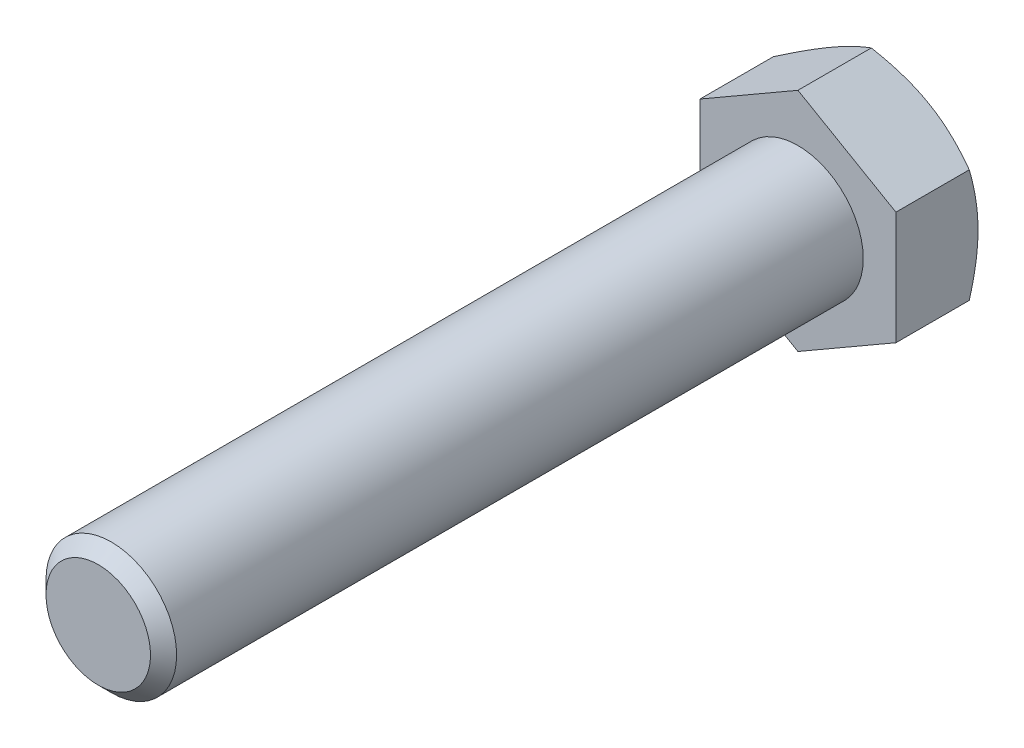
ISO-10303-21;
HEADER;
FILE_DESCRIPTION(('STEP AP214'),'2;1');
FILE_NAME('part.step','',(''),(''),'','','');
FILE_SCHEMA(('AUTOMOTIVE_DESIGN { 1 0 10303 214 1 1 1 1 }'));
ENDSEC;
DATA;
#1=APPLICATION_CONTEXT('core data for automotive mechanical design processes');
#2=APPLICATION_PROTOCOL_DEFINITION('international standard','automotive_design',2000,#1);
#3=PRODUCT_CONTEXT('',#1,'mechanical');
#4=PRODUCT('Part','Part','',(#3));
#5=PRODUCT_RELATED_PRODUCT_CATEGORY('part','',(#4));
#6=PRODUCT_DEFINITION_FORMATION('','',#4);
#7=PRODUCT_DEFINITION_CONTEXT('part definition',#1,'design');
#8=PRODUCT_DEFINITION('design','',#6,#7);
#9=PRODUCT_DEFINITION_SHAPE('','',#8);
#10=(LENGTH_UNIT() NAMED_UNIT(*) SI_UNIT(.MILLI.,.METRE.));
#11=(NAMED_UNIT(*) PLANE_ANGLE_UNIT() SI_UNIT($,.RADIAN.));
#12=(NAMED_UNIT(*) SI_UNIT($,.STERADIAN.) SOLID_ANGLE_UNIT());
#13=UNCERTAINTY_MEASURE_WITH_UNIT(LENGTH_MEASURE(1.E-05),#10,'distance_accuracy_value','');
#14=(GEOMETRIC_REPRESENTATION_CONTEXT(3) GLOBAL_UNCERTAINTY_ASSIGNED_CONTEXT((#13)) GLOBAL_UNIT_ASSIGNED_CONTEXT((#10,
#11,#12)) REPRESENTATION_CONTEXT('',''));
#15=CARTESIAN_POINT('',(0.,0.,0.));
#16=DIRECTION('',(0.,0.,1.));
#17=DIRECTION('',(1.,0.,0.));
#18=AXIS2_PLACEMENT_3D('',#15,#16,#17);
#19=CARTESIAN_POINT('',(0.,0.,75.));
#20=DIRECTION('',(0.,0.,1.));
#21=DIRECTION('',(1.,0.,0.));
#22=AXIS2_PLACEMENT_3D('',#19,#20,#21);
#23=PLANE('',#22);
#24=CARTESIAN_POINT('',(0.,0.,75.));
#25=DIRECTION('',(0.,0.,1.));
#26=DIRECTION('',(1.,0.,0.));
#27=AXIS2_PLACEMENT_3D('',#24,#25,#26);
#28=CIRCLE('',#27,5.60000000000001);
#29=CARTESIAN_POINT('',(-5.59999999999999,0.,75.));
#30=VERTEX_POINT('',#29);
#31=EDGE_CURVE('E271',#30,#30,#28,.T.);
#32=ORIENTED_EDGE('',*,*,#31,.T.);
#33=EDGE_LOOP('',(#32));
#34=FACE_BOUND('',#33,.T.);
#35=ADVANCED_FACE('F34',(#34),#23,.T.);
#36=CARTESIAN_POINT('',(0.,0.,0.));
#37=DIRECTION('',(0.,0.,1.));
#38=DIRECTION('',(1.,0.,0.));
#39=AXIS2_PLACEMENT_3D('',#36,#37,#38);
#40=CYLINDRICAL_SURFACE('',#39,7.);
#41=CARTESIAN_POINT('',(0.,0.,73.6));
#42=DIRECTION('',(0.,0.,1.));
#43=DIRECTION('',(1.,0.,0.));
#44=AXIS2_PLACEMENT_3D('',#41,#42,#43);
#45=CIRCLE('',#44,7.);
#46=CARTESIAN_POINT('',(-6.99999999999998,0.,73.6));
#47=VERTEX_POINT('',#46);
#48=EDGE_CURVE('E242',#47,#47,#45,.F.);
#49=ORIENTED_EDGE('',*,*,#48,.T.);
#50=EDGE_LOOP('',(#49));
#51=FACE_BOUND('',#50,.T.);
#52=CARTESIAN_POINT('',(0.,0.,0.));
#53=DIRECTION('',(0.,0.,1.));
#54=DIRECTION('',(1.,0.,0.));
#55=AXIS2_PLACEMENT_3D('',#52,#53,#54);
#56=CIRCLE('',#55,7.);
#57=CARTESIAN_POINT('',(7.,0.,0.));
#58=VERTEX_POINT('',#57);
#59=EDGE_CURVE('E268',#58,#58,#56,.F.);
#60=ORIENTED_EDGE('',*,*,#59,.F.);
#61=EDGE_LOOP('',(#60));
#62=FACE_BOUND('',#61,.T.);
#63=ADVANCED_FACE('F206',(#51,#62),#40,.T.);
#64=CARTESIAN_POINT('',(0.,0.,75.));
#65=DIRECTION('',(0.,0.,-1.));
#66=DIRECTION('',(-1.,0.,0.));
#67=AXIS2_PLACEMENT_3D('',#64,#65,#66);
#68=CONICAL_SURFACE('',#67,5.60000000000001,0.785398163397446);
#69=CARTESIAN_POINT('',(-6.99999999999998,0.,73.6));
#70=CARTESIAN_POINT('',(-6.98541666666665,0.,73.6145833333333));
#71=CARTESIAN_POINT('',(-6.97083333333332,0.,73.6291666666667));
#72=CARTESIAN_POINT('',(-6.94166666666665,0.,73.6583333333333));
#73=CARTESIAN_POINT('',(-6.92708333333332,0.,73.6729166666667));
#74=CARTESIAN_POINT('',(-6.89791666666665,0.,73.7020833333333));
#75=CARTESIAN_POINT('',(-6.88333333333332,0.,73.7166666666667));
#76=CARTESIAN_POINT('',(-6.85416666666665,0.,73.7458333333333));
#77=CARTESIAN_POINT('',(-6.83958333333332,0.,73.7604166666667));
#78=CARTESIAN_POINT('',(-6.81041666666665,0.,73.7895833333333));
#79=CARTESIAN_POINT('',(-6.79583333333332,0.,73.8041666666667));
#80=CARTESIAN_POINT('',(-6.76666666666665,0.,73.8333333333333));
#81=CARTESIAN_POINT('',(-6.75208333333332,0.,73.8479166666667));
#82=CARTESIAN_POINT('',(-6.72291666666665,0.,73.8770833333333));
#83=CARTESIAN_POINT('',(-6.70833333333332,0.,73.8916666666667));
#84=CARTESIAN_POINT('',(-6.67916666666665,0.,73.9208333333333));
#85=CARTESIAN_POINT('',(-6.66458333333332,0.,73.9354166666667));
#86=CARTESIAN_POINT('',(-6.63541666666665,0.,73.9645833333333));
#87=CARTESIAN_POINT('',(-6.62083333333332,0.,73.9791666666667));
#88=CARTESIAN_POINT('',(-6.59166666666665,0.,74.0083333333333));
#89=CARTESIAN_POINT('',(-6.57708333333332,0.,74.0229166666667));
#90=CARTESIAN_POINT('',(-6.54791666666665,0.,74.0520833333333));
#91=CARTESIAN_POINT('',(-6.53333333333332,0.,74.0666666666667));
#92=CARTESIAN_POINT('',(-6.50416666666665,0.,74.0958333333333));
#93=CARTESIAN_POINT('',(-6.48958333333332,0.,74.1104166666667));
#94=CARTESIAN_POINT('',(-6.46041666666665,0.,74.1395833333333));
#95=CARTESIAN_POINT('',(-6.44583333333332,0.,74.1541666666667));
#96=CARTESIAN_POINT('',(-6.41666666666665,0.,74.1833333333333));
#97=CARTESIAN_POINT('',(-6.40208333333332,0.,74.1979166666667));
#98=CARTESIAN_POINT('',(-6.37291666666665,0.,74.2270833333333));
#99=CARTESIAN_POINT('',(-6.35833333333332,0.,74.2416666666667));
#100=CARTESIAN_POINT('',(-6.32916666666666,0.,74.2708333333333));
#101=CARTESIAN_POINT('',(-6.31458333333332,0.,74.2854166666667));
#102=CARTESIAN_POINT('',(-6.28541666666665,0.,74.3145833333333));
#103=CARTESIAN_POINT('',(-6.27083333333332,0.,74.3291666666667));
#104=CARTESIAN_POINT('',(-6.24166666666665,0.,74.3583333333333));
#105=CARTESIAN_POINT('',(-6.22708333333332,0.,74.3729166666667));
#106=CARTESIAN_POINT('',(-6.19791666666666,0.,74.4020833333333));
#107=CARTESIAN_POINT('',(-6.18333333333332,0.,74.4166666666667));
#108=CARTESIAN_POINT('',(-6.15416666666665,0.,74.4458333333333));
#109=CARTESIAN_POINT('',(-6.13958333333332,0.,74.4604166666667));
#110=CARTESIAN_POINT('',(-6.11041666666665,0.,74.4895833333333));
#111=CARTESIAN_POINT('',(-6.09583333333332,0.,74.5041666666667));
#112=CARTESIAN_POINT('',(-6.06666666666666,0.,74.5333333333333));
#113=CARTESIAN_POINT('',(-6.05208333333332,0.,74.5479166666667));
#114=CARTESIAN_POINT('',(-6.02291666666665,0.,74.5770833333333));
#115=CARTESIAN_POINT('',(-6.00833333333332,0.,74.5916666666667));
#116=CARTESIAN_POINT('',(-5.97916666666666,0.,74.6208333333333));
#117=CARTESIAN_POINT('',(-5.96458333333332,0.,74.6354166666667));
#118=CARTESIAN_POINT('',(-5.93541666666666,0.,74.6645833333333));
#119=CARTESIAN_POINT('',(-5.92083333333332,0.,74.6791666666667));
#120=CARTESIAN_POINT('',(-5.89166666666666,0.,74.7083333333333));
#121=CARTESIAN_POINT('',(-5.87708333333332,0.,74.7229166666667));
#122=CARTESIAN_POINT('',(-5.84791666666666,0.,74.7520833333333));
#123=CARTESIAN_POINT('',(-5.83333333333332,0.,74.7666666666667));
#124=CARTESIAN_POINT('',(-5.80416666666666,0.,74.7958333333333));
#125=CARTESIAN_POINT('',(-5.78958333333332,0.,74.8104166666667));
#126=CARTESIAN_POINT('',(-5.76041666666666,0.,74.8395833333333));
#127=CARTESIAN_POINT('',(-5.74583333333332,0.,74.8541666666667));
#128=CARTESIAN_POINT('',(-5.71666666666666,0.,74.8833333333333));
#129=CARTESIAN_POINT('',(-5.70208333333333,0.,74.8979166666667));
#130=CARTESIAN_POINT('',(-5.67291666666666,0.,74.9270833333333));
#131=CARTESIAN_POINT('',(-5.65833333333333,0.,74.9416666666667));
#132=CARTESIAN_POINT('',(-5.62916666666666,0.,74.9708333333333));
#133=CARTESIAN_POINT('',(-5.61458333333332,0.,74.9854166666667));
#134=CARTESIAN_POINT('',(-5.59999999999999,0.,75.));
#135=B_SPLINE_CURVE_WITH_KNOTS('',3,(#69,#70,#71,#72,#73,#74,#75,#76,#77,#78,#79,#80,#81,#82,
#83,#84,#85,#86,#87,#88,#89,#90,#91,#92,#93,#94,#95,#96,#97,#98,#99,#100,#101,#102,#103,#104,
#105,#106,#107,#108,#109,#110,#111,#112,#113,#114,#115,#116,#117,#118,#119,#120,#121,#122,#123,
#124,#125,#126,#127,#128,#129,#130,#131,#132,#133,#134),.UNSPECIFIED.,.F.,.F.,(4,2,2,2,2,2,2,2,
2,2,2,2,2,2,2,2,2,2,2,2,2,2,2,2,2,2,2,2,2,2,2,2,4),(0.,0.0618718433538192,0.123743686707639,
0.185615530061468,0.247487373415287,0.309359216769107,0.371231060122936,0.433102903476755,
0.494974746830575,0.556846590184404,0.618718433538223,0.680590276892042,0.742462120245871,
0.804333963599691,0.86620580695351,0.928077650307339,0.989949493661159,1.05182133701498,
1.11369318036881,1.17556502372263,1.23743686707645,1.29930871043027,1.36118055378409,
1.42305239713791,1.48492424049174,1.54679608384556,1.60866792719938,1.67053977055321,
1.73241161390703,1.79428345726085,1.85615530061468,1.9180271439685,1.97989898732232),.UNSPECIFIED.);
#136=EDGE_CURVE('BSEAM36',#47,#30,#135,.T.);
#137=ORIENTED_EDGE('',*,*,#48,.F.);
#138=ORIENTED_EDGE('',*,*,#31,.F.);
#139=ORIENTED_EDGE('',*,*,#136,.T.);
#140=ORIENTED_EDGE('',*,*,#136,.F.);
#141=EDGE_LOOP('',(#137,#139,#138,#140));
#142=FACE_BOUND('',#141,.T.);
#143=ADVANCED_FACE('F36',(#142),#68,.T.);
#144=CARTESIAN_POINT('',(0.,12.1243556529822,-8.8));
#145=DIRECTION('',(0.499999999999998,0.86602540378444,0.));
#146=DIRECTION('',(-0.86602540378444,0.499999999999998,0.));
#147=AXIS2_PLACEMENT_3D('',#144,#145,#146);
#148=PLANE('',#147);
#149=CARTESIAN_POINT('',(-0.000200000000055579,12.124471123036,-7.86211115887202));
#150=CARTESIAN_POINT('',(0.230612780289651,11.9912113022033,-7.93903608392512));
#151=CARTESIAN_POINT('',(0.462286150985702,11.8574546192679,-8.0124696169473));
#152=CARTESIAN_POINT('',(0.92749073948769,11.588868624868,-8.15138514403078));
#153=CARTESIAN_POINT('',(1.161022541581,11.4540389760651,-8.21686452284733));
#154=CARTESIAN_POINT('',(1.86538084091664,11.0473775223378,-8.40010423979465));
#155=CARTESIAN_POINT('',(2.33898788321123,10.7739403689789,-8.50433004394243));
#156=CARTESIAN_POINT('',(3.04771913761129,10.3647541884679,-8.62654435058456));
#157=CARTESIAN_POINT('',(3.28072597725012,10.2302276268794,-8.66135857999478));
#158=CARTESIAN_POINT('',(3.7478184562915,9.9605516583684,-8.71973973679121));
#159=CARTESIAN_POINT('',(3.98190411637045,9.82540223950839,-8.74330644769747));
#160=CARTESIAN_POINT('',(4.45046590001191,9.55487796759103,-8.77858873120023));
#161=CARTESIAN_POINT('',(4.68494122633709,9.41950357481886,-8.79031838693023));
#162=CARTESIAN_POINT('',(5.15410845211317,9.14862975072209,-8.80167731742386));
#163=CARTESIAN_POINT('',(5.38880034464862,9.01313032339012,-8.80130696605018));
#164=CARTESIAN_POINT('',(5.82756124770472,8.7598115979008,-8.78930773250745));
#165=CARTESIAN_POINT('',(6.03166122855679,8.64197441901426,-8.77914260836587));
#166=CARTESIAN_POINT('',(6.43938384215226,8.40657565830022,-8.74985839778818));
#167=CARTESIAN_POINT('',(6.64300644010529,8.28901409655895,-8.73073867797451));
#168=CARTESIAN_POINT('',(7.25308524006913,7.93678493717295,-8.6603996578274));
#169=CARTESIAN_POINT('',(7.65846156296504,7.70274080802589,-8.59620926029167));
#170=CARTESIAN_POINT('',(8.47351422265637,7.23216993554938,-8.43573291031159));
#171=CARTESIAN_POINT('',(8.88308654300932,6.99570324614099,-8.33876673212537));
#172=CARTESIAN_POINT('',(9.69612354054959,6.52629611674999,-8.11869386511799));
#173=CARTESIAN_POINT('',(10.0995986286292,6.29334966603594,-7.9956388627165));
#174=CARTESIAN_POINT('',(10.5002,6.06206235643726,-7.86211115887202));
#175=B_SPLINE_CURVE_WITH_KNOTS('',3,(#149,#150,#151,#152,#153,#154,#155,#156,#157,#158,#159,
#160,#161,#162,#163,#164,#165,#166,#167,#168,#169,#170,#171,#172,#173,#174),.UNSPECIFIED.,.F.,
.F.,(4,2,2,2,2,2,2,2,2,2,2,2,4),(0.,0.832130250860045,1.66453336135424,3.33288308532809,
4.1465822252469,4.96029702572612,5.77304256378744,6.58576298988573,7.29326708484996,
8.0008212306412,9.41693497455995,10.8644544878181,12.3091325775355),.UNSPECIFIED.);
#176=CARTESIAN_POINT('',(0.,12.1243556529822,-7.86217782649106));
#177=VERTEX_POINT('',#176);
#178=CARTESIAN_POINT('',(5.24999999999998,9.09326673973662,-8.8));
#179=VERTEX_POINT('',#178);
#180=EDGE_CURVE('E230',#177,#179,#175,.T.);
#181=ORIENTED_EDGE('',*,*,#180,.F.);
#182=DIRECTION('',(0.,0.,1.));
#183=VECTOR('',#182,1.);
#184=CARTESIAN_POINT('',(0.,12.1243556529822,-8.8));
#185=LINE('',#184,#183);
#186=CARTESIAN_POINT('',(0.,12.1243556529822,0.));
#187=VERTEX_POINT('',#186);
#188=EDGE_CURVE('E227',#177,#187,#185,.T.);
#189=ORIENTED_EDGE('',*,*,#188,.T.);
#190=DIRECTION('',(-0.86602540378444,0.499999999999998,0.));
#191=VECTOR('',#190,1.);
#192=CARTESIAN_POINT('',(0.,12.1243556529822,0.));
#193=LINE('',#192,#191);
#194=CARTESIAN_POINT('',(10.5,6.06217782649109,0.));
#195=VERTEX_POINT('',#194);
#196=EDGE_CURVE('E235',#195,#187,#193,.T.);
#197=ORIENTED_EDGE('',*,*,#196,.F.);
#198=DIRECTION('',(0.,0.,1.));
#199=VECTOR('',#198,1.);
#200=CARTESIAN_POINT('',(10.5,6.06217782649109,-8.8));
#201=LINE('',#200,#199);
#202=CARTESIAN_POINT('',(10.5,6.0621778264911,-7.86217782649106));
#203=VERTEX_POINT('',#202);
#204=EDGE_CURVE('E260',#203,#195,#201,.T.);
#205=ORIENTED_EDGE('',*,*,#204,.F.);
#206=EDGE_CURVE('E179',#179,#203,#175,.T.);
#207=ORIENTED_EDGE('',*,*,#206,.F.);
#208=EDGE_LOOP('',(#181,#189,#197,#205,#207));
#209=FACE_BOUND('',#208,.T.);
#210=ADVANCED_FACE('F190',(#209),#148,.T.);
#211=CARTESIAN_POINT('',(10.5,-6.06217782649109,-8.8));
#212=DIRECTION('',(1.,0.,0.));
#213=DIRECTION('',(0.,0.,-1.));
#214=AXIS2_PLACEMENT_3D('',#211,#212,#213);
#215=PLANE('',#214);
#216=CARTESIAN_POINT('',(10.5,-16.5629789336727,-3.53989491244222));
#217=CARTESIAN_POINT('',(10.5,-16.3324493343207,-3.65230404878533));
#218=CARTESIAN_POINT('',(10.5,-16.1016566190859,-3.76417333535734));
#219=CARTESIAN_POINT('',(10.5,-15.6394901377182,-3.98671045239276));
#220=CARTESIAN_POINT('',(10.5,-15.4081163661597,-4.09737827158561));
#221=CARTESIAN_POINT('',(10.5,-14.712983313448,-4.42742432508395));
#222=CARTESIAN_POINT('',(10.5,-14.248276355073,-4.64481383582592));
#223=CARTESIAN_POINT('',(10.5,-13.3134466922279,-5.07413775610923));
#224=CARTESIAN_POINT('',(10.5,-12.8433084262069,-5.2860383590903));
#225=CARTESIAN_POINT('',(10.5,-11.8993888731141,-5.70153466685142));
#226=CARTESIAN_POINT('',(10.5,-11.4256077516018,-5.90513074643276));
#227=CARTESIAN_POINT('',(10.5,-10.4574367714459,-6.30858523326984));
#228=CARTESIAN_POINT('',(10.5,-9.96289464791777,-6.50808008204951));
#229=CARTESIAN_POINT('',(10.5,-8.96812552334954,-6.89263703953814));
#230=CARTESIAN_POINT('',(10.5,-8.46789790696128,-7.07769756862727));
#231=CARTESIAN_POINT('',(10.5,-7.46182642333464,-7.42872878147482));
#232=CARTESIAN_POINT('',(10.5,-6.95599532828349,-7.59473578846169));
#233=CARTESIAN_POINT('',(10.5,-5.93703641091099,-7.90252989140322));
#234=CARTESIAN_POINT('',(10.5,-5.42391085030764,-8.0443243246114));
#235=CARTESIAN_POINT('',(10.5,-4.65004411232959,-8.23348309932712));
#236=CARTESIAN_POINT('',(10.5,-4.39213073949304,-8.29247932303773));
#237=CARTESIAN_POINT('',(10.5,-3.87449212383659,-8.40194855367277));
#238=CARTESIAN_POINT('',(10.5,-3.61476691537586,-8.45242172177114));
#239=CARTESIAN_POINT('',(10.5,-3.09366450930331,-8.54397190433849));
#240=CARTESIAN_POINT('',(10.5,-2.83228735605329,-8.58504917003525));
#241=CARTESIAN_POINT('',(10.5,-2.30813350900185,-8.65699998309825));
#242=CARTESIAN_POINT('',(10.5,-2.04535687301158,-8.68787394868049));
#243=CARTESIAN_POINT('',(10.5,-1.5223239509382,-8.7384014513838));
#244=CARTESIAN_POINT('',(10.5,-1.26208192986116,-8.75820173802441));
#245=CARTESIAN_POINT('',(10.5,-0.740993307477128,-8.78676818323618));
#246=CARTESIAN_POINT('',(10.5,-0.480146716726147,-8.79553453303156));
#247=CARTESIAN_POINT('',(10.5,0.0416860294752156,-8.80182303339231));
#248=CARTESIAN_POINT('',(10.5,0.302672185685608,-8.79934512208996));
#249=CARTESIAN_POINT('',(10.5,0.824301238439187,-8.78320850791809));
#250=CARTESIAN_POINT('',(10.5,1.08494411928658,-8.76954931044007));
#251=CARTESIAN_POINT('',(10.5,1.70298182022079,-8.72419928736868));
#252=CARTESIAN_POINT('',(10.5,2.0600298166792,-8.68766932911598));
#253=CARTESIAN_POINT('',(10.5,2.77164016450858,-8.59555782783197));
#254=CARTESIAN_POINT('',(10.5,3.12620220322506,-8.53997393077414));
#255=CARTESIAN_POINT('',(10.5,4.18565161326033,-8.34757543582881));
#256=CARTESIAN_POINT('',(10.5,4.88595752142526,-8.1851428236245));
#257=CARTESIAN_POINT('',(10.5,5.93370494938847,-7.90132203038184));
#258=CARTESIAN_POINT('',(10.5,6.28651822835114,-7.79860514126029));
#259=CARTESIAN_POINT('',(10.5,6.98872323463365,-7.58197095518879));
#260=CARTESIAN_POINT('',(10.5,7.33811493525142,-7.4680535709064));
#261=CARTESIAN_POINT('',(10.5,8.03358066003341,-7.23088999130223));
#262=CARTESIAN_POINT('',(10.5,8.37965557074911,-7.10764637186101));
#263=CARTESIAN_POINT('',(10.5,9.06889903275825,-6.85333339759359));
#264=CARTESIAN_POINT('',(10.5,9.41206765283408,-6.72226422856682));
#265=CARTESIAN_POINT('',(10.5,10.3427918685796,-6.35655861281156));
#266=CARTESIAN_POINT('',(10.5,10.9278216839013,-6.1154998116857));
#267=CARTESIAN_POINT('',(10.5,12.0917802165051,-5.61902471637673));
#268=CARTESIAN_POINT('',(10.5,12.6707082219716,-5.36360676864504));
#269=CARTESIAN_POINT('',(10.5,13.8238790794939,-4.8418421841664));
#270=CARTESIAN_POINT('',(10.5,14.398119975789,-4.5754912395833));
#271=CARTESIAN_POINT('',(10.5,15.542640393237,-4.03450017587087));
#272=CARTESIAN_POINT('',(10.5,16.1129200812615,-3.75986040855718));
#273=CARTESIAN_POINT('',(10.5,17.2512491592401,-3.20365321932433));
#274=CARTESIAN_POINT('',(10.5,17.8192933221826,-2.92207512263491));
#275=CARTESIAN_POINT('',(10.5,18.9528074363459,-2.35378095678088));
#276=CARTESIAN_POINT('',(10.5,19.5182773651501,-2.06706484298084));
#277=CARTESIAN_POINT('',(10.5,20.6469787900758,-1.48957659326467));
#278=CARTESIAN_POINT('',(10.5,21.210210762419,-1.19880538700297));
#279=CARTESIAN_POINT('',(10.5,22.3349267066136,-0.613909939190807));
#280=CARTESIAN_POINT('',(10.5,22.8964106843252,-0.319785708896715));
#281=CARTESIAN_POINT('',(10.5,24.4583663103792,0.503299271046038));
#282=CARTESIAN_POINT('',(10.5,25.4572548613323,1.03526359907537));
#283=CARTESIAN_POINT('',(10.5,27.4516969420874,2.10554559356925));
#284=CARTESIAN_POINT('',(10.5,28.4472502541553,2.64386366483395));
#285=CARTESIAN_POINT('',(10.5,30.4323747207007,3.7233782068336));
#286=CARTESIAN_POINT('',(10.5,31.4219546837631,4.26455848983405));
#287=CARTESIAN_POINT('',(10.5,32.9047991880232,5.07900862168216));
#288=CARTESIAN_POINT('',(10.5,33.3988066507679,5.35092764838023));
#289=CARTESIAN_POINT('',(10.5,34.3863794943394,5.89556593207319));
#290=CARTESIAN_POINT('',(10.5,34.8799448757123,6.16828518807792));
#291=CARTESIAN_POINT('',(10.5,35.3733163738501,6.44135483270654));
#292=B_SPLINE_CURVE_WITH_KNOTS('',3,(#216,#217,#218,#219,#220,#221,#222,#223,#224,#225,#226,
#227,#228,#229,#230,#231,#232,#233,#234,#235,#236,#237,#238,#239,#240,#241,#242,#243,#244,#245,
#246,#247,#248,#249,#250,#251,#252,#253,#254,#255,#256,#257,#258,#259,#260,#261,#262,#263,#264,
#265,#266,#267,#268,#269,#270,#271,#272,#273,#274,#275,#276,#277,#278,#279,#280,#281,#282,#283,
#284,#285,#286,#287,#288,#289,#290,#291),.UNSPECIFIED.,.F.,.F.,(4,2,2,2,2,2,2,2,2,2,2,2,2,2,2,2,
2,2,2,2,2,2,2,2,2,2,2,2,2,2,2,2,2,2,2,2,2,4),(0.,0.769425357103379,1.53885792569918,
3.07793697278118,4.62493168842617,6.17185650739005,7.77147528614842,9.37126887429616,
10.9679601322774,12.5641666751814,13.357773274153,14.1513648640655,14.9449352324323,
15.7384730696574,16.5212293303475,17.303972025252,18.0867190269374,18.8695006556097,
19.9456341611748,21.0219006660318,23.1754668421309,24.2777514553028,25.3800446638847,
26.4820345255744,27.5839982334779,29.4819519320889,31.3801246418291,33.279052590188,
35.1779000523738,37.0798780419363,38.9818725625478,40.8834379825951,42.7849970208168,
46.1800870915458,49.5753946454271,52.9590658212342,54.650765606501,56.3424632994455),.UNSPECIFIED.);
#293=CARTESIAN_POINT('',(10.5,0.,-8.8));
#294=VERTEX_POINT('',#293);
#295=EDGE_CURVE('E177',#203,#294,#292,.F.);
#296=ORIENTED_EDGE('',*,*,#295,.F.);
#297=ORIENTED_EDGE('',*,*,#204,.T.);
#298=DIRECTION('',(0.,1.,0.));
#299=VECTOR('',#298,1.);
#300=CARTESIAN_POINT('',(10.5,-6.06217782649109,0.));
#301=LINE('',#300,#299);
#302=CARTESIAN_POINT('',(10.5,-6.06217782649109,0.));
#303=VERTEX_POINT('',#302);
#304=EDGE_CURVE('E267',#303,#195,#301,.T.);
#305=ORIENTED_EDGE('',*,*,#304,.F.);
#306=DIRECTION('',(0.,0.,1.));
#307=VECTOR('',#306,1.);
#308=CARTESIAN_POINT('',(10.5,-6.06217782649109,-8.8));
#309=LINE('',#308,#307);
#310=CARTESIAN_POINT('',(10.5,-6.06217782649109,-7.86217782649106));
#311=VERTEX_POINT('',#310);
#312=EDGE_CURVE('E245',#311,#303,#309,.T.);
#313=ORIENTED_EDGE('',*,*,#312,.F.);
#314=EDGE_CURVE('E171',#294,#311,#292,.F.);
#315=ORIENTED_EDGE('',*,*,#314,.F.);
#316=EDGE_LOOP('',(#296,#297,#305,#313,#315));
#317=FACE_BOUND('',#316,.T.);
#318=ADVANCED_FACE('F186',(#317),#215,.T.);
#319=CARTESIAN_POINT('',(0.,-12.1243556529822,-8.8));
#320=DIRECTION('',(0.499999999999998,-0.86602540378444,0.));
#321=DIRECTION('',(0.86602540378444,0.499999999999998,0.));
#322=AXIS2_PLACEMENT_3D('',#319,#320,#321);
#323=PLANE('',#322);
#324=CARTESIAN_POINT('',(10.5002,-6.06206235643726,-7.86211115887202));
#325=CARTESIAN_POINT('',(10.2693872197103,-6.19532217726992,-7.93903608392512));
#326=CARTESIAN_POINT('',(10.0377138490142,-6.32907886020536,-8.01246961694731));
#327=CARTESIAN_POINT('',(9.57250926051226,-6.59766485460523,-8.15138514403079));
#328=CARTESIAN_POINT('',(9.33897745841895,-6.73249450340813,-8.21686452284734));
#329=CARTESIAN_POINT('',(8.63461915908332,-7.13915595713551,-8.40010423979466));
#330=CARTESIAN_POINT('',(8.16101211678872,-7.4125931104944,-8.50433004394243));
#331=CARTESIAN_POINT('',(7.45228086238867,-7.82177929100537,-8.62654435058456));
#332=CARTESIAN_POINT('',(7.21927402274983,-7.95630585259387,-8.66135857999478));
#333=CARTESIAN_POINT('',(6.75218154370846,-8.22598182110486,-8.71973973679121));
#334=CARTESIAN_POINT('',(6.5180958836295,-8.36113123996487,-8.74330644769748));
#335=CARTESIAN_POINT('',(6.04953409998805,-8.63165551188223,-8.77858873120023));
#336=CARTESIAN_POINT('',(5.81505877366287,-8.7670299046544,-8.79031838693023));
#337=CARTESIAN_POINT('',(5.34589154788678,-9.03790372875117,-8.80167731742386));
#338=CARTESIAN_POINT('',(5.11119965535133,-9.17340315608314,-8.80130696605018));
#339=CARTESIAN_POINT('',(4.67243875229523,-9.42672188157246,-8.78930773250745));
#340=CARTESIAN_POINT('',(4.46833877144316,-9.544559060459,-8.77914260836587));
#341=CARTESIAN_POINT('',(4.06061615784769,-9.77995782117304,-8.74985839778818));
#342=CARTESIAN_POINT('',(3.85699355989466,-9.89751938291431,-8.73073867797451));
#343=CARTESIAN_POINT('',(3.24691475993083,-10.2497485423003,-8.6603996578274));
#344=CARTESIAN_POINT('',(2.84153843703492,-10.4837926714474,-8.59620926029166));
#345=CARTESIAN_POINT('',(2.02648577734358,-10.9543635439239,-8.43573291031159));
#346=CARTESIAN_POINT('',(1.61691345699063,-11.1908302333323,-8.33876673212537));
#347=CARTESIAN_POINT('',(0.803876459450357,-11.6602373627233,-8.11869386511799));
#348=CARTESIAN_POINT('',(0.400401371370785,-11.8931838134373,-7.99563886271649));
#349=CARTESIAN_POINT('',(-0.000200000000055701,-12.124471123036,-7.86211115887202));
#350=B_SPLINE_CURVE_WITH_KNOTS('',3,(#324,#325,#326,#327,#328,#329,#330,#331,#332,#333,#334,
#335,#336,#337,#338,#339,#340,#341,#342,#343,#344,#345,#346,#347,#348,#349),.UNSPECIFIED.,.F.,
.F.,(4,2,2,2,2,2,2,2,2,2,2,2,4),(0.,0.832130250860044,1.66453336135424,3.33288308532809,
4.1465822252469,4.96029702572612,5.77304256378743,6.58576298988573,7.29326708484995,
8.0008212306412,9.41693497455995,10.8644544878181,12.3091325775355),.UNSPECIFIED.);
#351=CARTESIAN_POINT('',(5.24999999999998,-9.09326673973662,-8.8));
#352=VERTEX_POINT('',#351);
#353=EDGE_CURVE('E178',#311,#352,#350,.T.);
#354=ORIENTED_EDGE('',*,*,#353,.F.);
#355=ORIENTED_EDGE('',*,*,#312,.T.);
#356=DIRECTION('',(0.86602540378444,0.499999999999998,0.));
#357=VECTOR('',#356,1.);
#358=CARTESIAN_POINT('',(0.,-12.1243556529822,0.));
#359=LINE('',#358,#357);
#360=CARTESIAN_POINT('',(0.,-12.1243556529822,0.));
#361=VERTEX_POINT('',#360);
#362=EDGE_CURVE('E256',#361,#303,#359,.T.);
#363=ORIENTED_EDGE('',*,*,#362,.F.);
#364=DIRECTION('',(0.,0.,1.));
#365=VECTOR('',#364,1.);
#366=CARTESIAN_POINT('',(0.,-12.1243556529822,-8.8));
#367=LINE('',#366,#365);
#368=CARTESIAN_POINT('',(0.,-12.1243556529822,-7.86217782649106));
#369=VERTEX_POINT('',#368);
#370=EDGE_CURVE('E255',#369,#361,#367,.T.);
#371=ORIENTED_EDGE('',*,*,#370,.F.);
#372=EDGE_CURVE('E164',#352,#369,#350,.T.);
#373=ORIENTED_EDGE('',*,*,#372,.F.);
#374=EDGE_LOOP('',(#354,#355,#363,#371,#373));
#375=FACE_BOUND('',#374,.T.);
#376=ADVANCED_FACE('F189',(#375),#323,.T.);
#377=CARTESIAN_POINT('',(0.,-12.1243556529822,-8.8));
#378=DIRECTION('',(-0.500000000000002,-0.866025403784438,0.));
#379=DIRECTION('',(0.866025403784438,-0.500000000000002,0.));
#380=AXIS2_PLACEMENT_3D('',#377,#378,#379);
#381=PLANE('',#380);
#382=CARTESIAN_POINT('',(0.000199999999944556,-12.124471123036,-7.86211115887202));
#383=CARTESIAN_POINT('',(-0.230612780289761,-11.9912113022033,-7.93903608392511));
#384=CARTESIAN_POINT('',(-0.462286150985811,-11.8574546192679,-8.0124696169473));
#385=CARTESIAN_POINT('',(-0.927490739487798,-11.588868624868,-8.15138514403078));
#386=CARTESIAN_POINT('',(-1.16102254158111,-11.4540389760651,-8.21686452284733));
#387=CARTESIAN_POINT('',(-1.86538084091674,-11.0473775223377,-8.40010423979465));
#388=CARTESIAN_POINT('',(-2.33898788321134,-10.7739403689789,-8.50433004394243));
#389=CARTESIAN_POINT('',(-3.04771913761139,-10.3647541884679,-8.62654435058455));
#390=CARTESIAN_POINT('',(-3.28072597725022,-10.2302276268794,-8.66135857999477));
#391=CARTESIAN_POINT('',(-3.7478184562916,-9.96055165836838,-8.7197397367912));
#392=CARTESIAN_POINT('',(-3.98190411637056,-9.82540223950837,-8.74330644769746));
#393=CARTESIAN_POINT('',(-4.45046590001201,-9.554877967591,-8.77858873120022));
#394=CARTESIAN_POINT('',(-4.68494122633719,-9.41950357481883,-8.79031838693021));
#395=CARTESIAN_POINT('',(-5.15410845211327,-9.14862975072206,-8.80167731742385));
#396=CARTESIAN_POINT('',(-5.38880034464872,-9.0131303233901,-8.80130696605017));
#397=CARTESIAN_POINT('',(-5.82756124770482,-8.75981159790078,-8.78930773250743));
#398=CARTESIAN_POINT('',(-6.03166122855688,-8.64197441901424,-8.77914260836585));
#399=CARTESIAN_POINT('',(-6.43938384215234,-8.4065756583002,-8.74985839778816));
#400=CARTESIAN_POINT('',(-6.64300644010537,-8.28901409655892,-8.73073867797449));
#401=CARTESIAN_POINT('',(-7.25308524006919,-7.93678493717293,-8.66039965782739));
#402=CARTESIAN_POINT('',(-7.65846156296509,-7.70274080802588,-8.59620926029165));
#403=CARTESIAN_POINT('',(-8.47351422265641,-7.23216993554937,-8.43573291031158));
#404=CARTESIAN_POINT('',(-8.88308654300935,-6.99570324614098,-8.33876673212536));
#405=CARTESIAN_POINT('',(-9.69612354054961,-6.52629611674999,-8.11869386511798));
#406=CARTESIAN_POINT('',(-10.0995986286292,-6.29334966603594,-7.99563886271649));
#407=CARTESIAN_POINT('',(-10.5002,-6.06206235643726,-7.86211115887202));
#408=B_SPLINE_CURVE_WITH_KNOTS('',3,(#382,#383,#384,#385,#386,#387,#388,#389,#390,#391,#392,
#393,#394,#395,#396,#397,#398,#399,#400,#401,#402,#403,#404,#405,#406,#407),.UNSPECIFIED.,.F.,
.F.,(4,2,2,2,2,2,2,2,2,2,2,2,4),(0.,0.832130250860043,1.66453336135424,3.33288308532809,
4.1465822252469,4.96029702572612,5.77304256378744,6.58576298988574,7.29326708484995,
8.00082123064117,9.4169349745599,10.864454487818,12.3091325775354),.UNSPECIFIED.);
#409=CARTESIAN_POINT('',(-5.25000000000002,-9.0932667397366,-8.8));
#410=VERTEX_POINT('',#409);
#411=EDGE_CURVE('E251',#369,#410,#408,.T.);
#412=ORIENTED_EDGE('',*,*,#411,.F.);
#413=ORIENTED_EDGE('',*,*,#370,.T.);
#414=DIRECTION('',(0.866025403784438,-0.500000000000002,0.));
#415=VECTOR('',#414,1.);
#416=CARTESIAN_POINT('',(0.,-12.1243556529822,0.));
#417=LINE('',#416,#415);
#418=CARTESIAN_POINT('',(-10.5,-6.06217782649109,0.));
#419=VERTEX_POINT('',#418);
#420=EDGE_CURVE('E389',#419,#361,#417,.T.);
#421=ORIENTED_EDGE('',*,*,#420,.F.);
#422=DIRECTION('',(0.,0.,1.));
#423=VECTOR('',#422,1.);
#424=CARTESIAN_POINT('',(-10.5,-6.06217782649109,-8.8));
#425=LINE('',#424,#423);
#426=CARTESIAN_POINT('',(-10.5,-6.06217782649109,-7.86217782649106));
#427=VERTEX_POINT('',#426);
#428=EDGE_CURVE('E258',#427,#419,#425,.T.);
#429=ORIENTED_EDGE('',*,*,#428,.F.);
#430=EDGE_CURVE('E111',#410,#427,#408,.T.);
#431=ORIENTED_EDGE('',*,*,#430,.F.);
#432=EDGE_LOOP('',(#412,#413,#421,#429,#431));
#433=FACE_BOUND('',#432,.T.);
#434=ADVANCED_FACE('F195',(#433),#381,.T.);
#435=CARTESIAN_POINT('',(-10.5,-6.06217782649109,-8.8));
#436=DIRECTION('',(-1.,0.,0.));
#437=DIRECTION('',(0.,0.,1.));
#438=AXIS2_PLACEMENT_3D('',#435,#436,#437);
#439=PLANE('',#438);
#440=CARTESIAN_POINT('',(-10.5,-16.5629789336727,-3.53989491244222));
#441=CARTESIAN_POINT('',(-10.5,-16.3324493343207,-3.65230404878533));
#442=CARTESIAN_POINT('',(-10.5,-16.1016566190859,-3.76417333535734));
#443=CARTESIAN_POINT('',(-10.5,-15.6394901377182,-3.98671045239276));
#444=CARTESIAN_POINT('',(-10.5,-15.4081163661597,-4.09737827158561));
#445=CARTESIAN_POINT('',(-10.5,-14.712983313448,-4.42742432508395));
#446=CARTESIAN_POINT('',(-10.5,-14.248276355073,-4.64481383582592));
#447=CARTESIAN_POINT('',(-10.5,-13.3134466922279,-5.07413775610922));
#448=CARTESIAN_POINT('',(-10.5,-12.8433084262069,-5.2860383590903));
#449=CARTESIAN_POINT('',(-10.5,-11.8993888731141,-5.70153466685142));
#450=CARTESIAN_POINT('',(-10.5,-11.4256077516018,-5.90513074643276));
#451=CARTESIAN_POINT('',(-10.5,-10.4574367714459,-6.30858523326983));
#452=CARTESIAN_POINT('',(-10.5,-9.96289464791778,-6.5080800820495));
#453=CARTESIAN_POINT('',(-10.5,-8.96812552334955,-6.89263703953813));
#454=CARTESIAN_POINT('',(-10.5,-8.46789790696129,-7.07769756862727));
#455=CARTESIAN_POINT('',(-10.5,-7.46182642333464,-7.42872878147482));
#456=CARTESIAN_POINT('',(-10.5,-6.9559953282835,-7.59473578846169));
#457=CARTESIAN_POINT('',(-10.5,-5.93703641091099,-7.90252989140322));
#458=CARTESIAN_POINT('',(-10.5,-5.42391085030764,-8.0443243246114));
#459=CARTESIAN_POINT('',(-10.5,-4.65004411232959,-8.23348309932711));
#460=CARTESIAN_POINT('',(-10.5,-4.39213073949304,-8.29247932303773));
#461=CARTESIAN_POINT('',(-10.5,-3.87449212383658,-8.40194855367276));
#462=CARTESIAN_POINT('',(-10.5,-3.61476691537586,-8.45242172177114));
#463=CARTESIAN_POINT('',(-10.5,-3.09366450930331,-8.54397190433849));
#464=CARTESIAN_POINT('',(-10.5,-2.83228735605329,-8.58504917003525));
#465=CARTESIAN_POINT('',(-10.5,-2.30813350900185,-8.65699998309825));
#466=CARTESIAN_POINT('',(-10.5,-2.04535687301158,-8.68787394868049));
#467=CARTESIAN_POINT('',(-10.5,-1.5223239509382,-8.7384014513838));
#468=CARTESIAN_POINT('',(-10.5,-1.26208192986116,-8.75820173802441));
#469=CARTESIAN_POINT('',(-10.5,-0.740993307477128,-8.78676818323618));
#470=CARTESIAN_POINT('',(-10.5,-0.480146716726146,-8.79553453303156));
#471=CARTESIAN_POINT('',(-10.5,0.0416860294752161,-8.80182303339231));
#472=CARTESIAN_POINT('',(-10.5,0.302672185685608,-8.79934512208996));
#473=CARTESIAN_POINT('',(-10.5,0.824301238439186,-8.78320850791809));
#474=CARTESIAN_POINT('',(-10.5,1.08494411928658,-8.76954931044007));
#475=CARTESIAN_POINT('',(-10.5,1.70298182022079,-8.72419928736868));
#476=CARTESIAN_POINT('',(-10.5,2.0600298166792,-8.68766932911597));
#477=CARTESIAN_POINT('',(-10.5,2.77164016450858,-8.59555782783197));
#478=CARTESIAN_POINT('',(-10.5,3.12620220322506,-8.53997393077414));
#479=CARTESIAN_POINT('',(-10.5,4.18565161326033,-8.34757543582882));
#480=CARTESIAN_POINT('',(-10.5,4.88595752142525,-8.1851428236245));
#481=CARTESIAN_POINT('',(-10.5,5.93370494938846,-7.90132203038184));
#482=CARTESIAN_POINT('',(-10.5,6.28651822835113,-7.79860514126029));
#483=CARTESIAN_POINT('',(-10.5,6.98872323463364,-7.5819709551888));
#484=CARTESIAN_POINT('',(-10.5,7.33811493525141,-7.4680535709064));
#485=CARTESIAN_POINT('',(-10.5,8.0335806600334,-7.23088999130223));
#486=CARTESIAN_POINT('',(-10.5,8.3796555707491,-7.10764637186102));
#487=CARTESIAN_POINT('',(-10.5,9.06889903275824,-6.85333339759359));
#488=CARTESIAN_POINT('',(-10.5,9.41206765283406,-6.72226422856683));
#489=CARTESIAN_POINT('',(-10.5,10.3427918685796,-6.35655861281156));
#490=CARTESIAN_POINT('',(-10.5,10.9278216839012,-6.1154998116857));
#491=CARTESIAN_POINT('',(-10.5,12.0917802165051,-5.61902471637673));
#492=CARTESIAN_POINT('',(-10.5,12.6707082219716,-5.36360676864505));
#493=CARTESIAN_POINT('',(-10.5,13.8238790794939,-4.84184218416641));
#494=CARTESIAN_POINT('',(-10.5,14.398119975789,-4.57549123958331));
#495=CARTESIAN_POINT('',(-10.5,15.542640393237,-4.03450017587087));
#496=CARTESIAN_POINT('',(-10.5,16.1129200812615,-3.75986040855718));
#497=CARTESIAN_POINT('',(-10.5,17.25124915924,-3.20365321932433));
#498=CARTESIAN_POINT('',(-10.5,17.8192933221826,-2.92207512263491));
#499=CARTESIAN_POINT('',(-10.5,18.9528074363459,-2.35378095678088));
#500=CARTESIAN_POINT('',(-10.5,19.5182773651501,-2.06706484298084));
#501=CARTESIAN_POINT('',(-10.5,20.6469787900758,-1.48957659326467));
#502=CARTESIAN_POINT('',(-10.5,21.210210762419,-1.19880538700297));
#503=CARTESIAN_POINT('',(-10.5,22.3349267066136,-0.613909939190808));
#504=CARTESIAN_POINT('',(-10.5,22.8964106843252,-0.319785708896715));
#505=CARTESIAN_POINT('',(-10.5,24.4583663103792,0.503299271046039));
#506=CARTESIAN_POINT('',(-10.5,25.4572548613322,1.03526359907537));
#507=CARTESIAN_POINT('',(-10.5,27.4516969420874,2.10554559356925));
#508=CARTESIAN_POINT('',(-10.5,28.4472502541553,2.64386366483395));
#509=CARTESIAN_POINT('',(-10.5,30.4323747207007,3.7233782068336));
#510=CARTESIAN_POINT('',(-10.5,31.4219546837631,4.26455848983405));
#511=CARTESIAN_POINT('',(-10.5,32.9047991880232,5.07900862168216));
#512=CARTESIAN_POINT('',(-10.5,33.3988066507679,5.35092764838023));
#513=CARTESIAN_POINT('',(-10.5,34.3863794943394,5.89556593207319));
#514=CARTESIAN_POINT('',(-10.5,34.8799448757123,6.16828518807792));
#515=CARTESIAN_POINT('',(-10.5,35.3733163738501,6.44135483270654));
#516=B_SPLINE_CURVE_WITH_KNOTS('',3,(#440,#441,#442,#443,#444,#445,#446,#447,#448,#449,#450,
#451,#452,#453,#454,#455,#456,#457,#458,#459,#460,#461,#462,#463,#464,#465,#466,#467,#468,#469,
#470,#471,#472,#473,#474,#475,#476,#477,#478,#479,#480,#481,#482,#483,#484,#485,#486,#487,#488,
#489,#490,#491,#492,#493,#494,#495,#496,#497,#498,#499,#500,#501,#502,#503,#504,#505,#506,#507,
#508,#509,#510,#511,#512,#513,#514,#515),.UNSPECIFIED.,.F.,.F.,(4,2,2,2,2,2,2,2,2,2,2,2,2,2,2,2,
2,2,2,2,2,2,2,2,2,2,2,2,2,2,2,2,2,2,2,2,2,4),(0.,0.769425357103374,1.53885792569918,
3.07793697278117,4.62493168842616,6.17185650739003,7.77147528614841,9.37126887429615,
10.9679601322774,12.5641666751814,13.357773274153,14.1513648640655,14.9449352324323,
15.7384730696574,16.5212293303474,17.303972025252,18.0867190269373,18.8695006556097,
19.9456341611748,21.0219006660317,23.1754668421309,24.2777514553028,25.3800446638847,
26.4820345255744,27.5839982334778,29.4819519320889,31.380124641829,33.279052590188,
35.1779000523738,37.0798780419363,38.9818725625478,40.8834379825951,42.7849970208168,
46.1800870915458,49.5753946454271,52.9590658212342,54.650765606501,56.3424632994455),.UNSPECIFIED.);
#517=CARTESIAN_POINT('',(-10.5,0.,-8.8));
#518=VERTEX_POINT('',#517);
#519=EDGE_CURVE('E106',#427,#518,#516,.T.);
#520=ORIENTED_EDGE('',*,*,#519,.F.);
#521=ORIENTED_EDGE('',*,*,#428,.T.);
#522=DIRECTION('',(0.,-1.,0.));
#523=VECTOR('',#522,1.);
#524=CARTESIAN_POINT('',(-10.5,-6.06217782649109,0.));
#525=LINE('',#524,#523);
#526=CARTESIAN_POINT('',(-10.5,6.06217782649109,0.));
#527=VERTEX_POINT('',#526);
#528=EDGE_CURVE('E391',#527,#419,#525,.T.);
#529=ORIENTED_EDGE('',*,*,#528,.F.);
#530=DIRECTION('',(0.,0.,1.));
#531=VECTOR('',#530,1.);
#532=CARTESIAN_POINT('',(-10.5,6.06217782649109,-8.8));
#533=LINE('',#532,#531);
#534=CARTESIAN_POINT('',(-10.5,6.06217782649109,-7.86217782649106));
#535=VERTEX_POINT('',#534);
#536=EDGE_CURVE('E132',#535,#527,#533,.T.);
#537=ORIENTED_EDGE('',*,*,#536,.F.);
#538=EDGE_CURVE('E115',#518,#535,#516,.T.);
#539=ORIENTED_EDGE('',*,*,#538,.F.);
#540=EDGE_LOOP('',(#520,#521,#529,#537,#539));
#541=FACE_BOUND('',#540,.T.);
#542=ADVANCED_FACE('F130',(#541),#439,.T.);
#543=CARTESIAN_POINT('',(-10.5,6.06217782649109,-8.8));
#544=DIRECTION('',(-0.500000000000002,0.866025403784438,0.));
#545=DIRECTION('',(-0.866025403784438,-0.500000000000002,0.));
#546=AXIS2_PLACEMENT_3D('',#543,#544,#545);
#547=PLANE('',#546);
#548=CARTESIAN_POINT('',(-10.5002,6.06206235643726,-7.86211115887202));
#549=CARTESIAN_POINT('',(-10.2693872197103,6.19532217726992,-7.93903608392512));
#550=CARTESIAN_POINT('',(-10.0377138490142,6.32907886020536,-8.01246961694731));
#551=CARTESIAN_POINT('',(-9.57250926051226,6.59766485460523,-8.15138514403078));
#552=CARTESIAN_POINT('',(-9.33897745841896,6.73249450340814,-8.21686452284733));
#553=CARTESIAN_POINT('',(-8.63461915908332,7.13915595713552,-8.40010423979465));
#554=CARTESIAN_POINT('',(-8.16101211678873,7.41259311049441,-8.50433004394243));
#555=CARTESIAN_POINT('',(-7.45228086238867,7.82177929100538,-8.62654435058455));
#556=CARTESIAN_POINT('',(-7.21927402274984,7.95630585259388,-8.66135857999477));
#557=CARTESIAN_POINT('',(-6.75218154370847,8.22598182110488,-8.7197397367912));
#558=CARTESIAN_POINT('',(-6.51809588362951,8.36113123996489,-8.74330644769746));
#559=CARTESIAN_POINT('',(-6.04953409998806,8.63165551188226,-8.77858873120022));
#560=CARTESIAN_POINT('',(-5.81505877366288,8.76702990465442,-8.79031838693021));
#561=CARTESIAN_POINT('',(-5.34589154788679,9.0379037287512,-8.80167731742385));
#562=CARTESIAN_POINT('',(-5.11119965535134,9.17340315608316,-8.80130696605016));
#563=CARTESIAN_POINT('',(-4.67243875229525,9.42672188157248,-8.78930773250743));
#564=CARTESIAN_POINT('',(-4.46833877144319,9.54455906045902,-8.77914260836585));
#565=CARTESIAN_POINT('',(-4.06061615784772,9.77995782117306,-8.74985839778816));
#566=CARTESIAN_POINT('',(-3.85699355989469,9.89751938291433,-8.73073867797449));
#567=CARTESIAN_POINT('',(-3.24691475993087,10.2497485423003,-8.66039965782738));
#568=CARTESIAN_POINT('',(-2.84153843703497,10.4837926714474,-8.59620926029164));
#569=CARTESIAN_POINT('',(-2.02648577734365,10.9543635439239,-8.43573291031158));
#570=CARTESIAN_POINT('',(-1.61691345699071,11.1908302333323,-8.33876673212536));
#571=CARTESIAN_POINT('',(-0.803876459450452,11.6602373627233,-8.11869386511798));
#572=CARTESIAN_POINT('',(-0.400401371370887,11.8931838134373,-7.99563886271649));
#573=CARTESIAN_POINT('',(0.00019999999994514,12.124471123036,-7.86211115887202));
#574=B_SPLINE_CURVE_WITH_KNOTS('',3,(#548,#549,#550,#551,#552,#553,#554,#555,#556,#557,#558,
#559,#560,#561,#562,#563,#564,#565,#566,#567,#568,#569,#570,#571,#572,#573),.UNSPECIFIED.,.F.,
.F.,(4,2,2,2,2,2,2,2,2,2,2,2,4),(0.,0.832130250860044,1.66453336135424,3.33288308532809,
4.1465822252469,4.96029702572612,5.77304256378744,6.58576298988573,7.29326708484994,
8.00082123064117,9.4169349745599,10.864454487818,12.3091325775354),.UNSPECIFIED.);
#575=CARTESIAN_POINT('',(-5.25000000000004,9.09326673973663,-8.8));
#576=VERTEX_POINT('',#575);
#577=EDGE_CURVE('E121',#535,#576,#574,.T.);
#578=ORIENTED_EDGE('',*,*,#577,.F.);
#579=ORIENTED_EDGE('',*,*,#536,.T.);
#580=DIRECTION('',(-0.866025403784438,-0.500000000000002,0.));
#581=VECTOR('',#580,1.);
#582=CARTESIAN_POINT('',(-10.5,6.06217782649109,0.));
#583=LINE('',#582,#581);
#584=EDGE_CURVE('E237',#187,#527,#583,.T.);
#585=ORIENTED_EDGE('',*,*,#584,.F.);
#586=ORIENTED_EDGE('',*,*,#188,.F.);
#587=EDGE_CURVE('E123',#576,#177,#574,.T.);
#588=ORIENTED_EDGE('',*,*,#587,.F.);
#589=EDGE_LOOP('',(#578,#579,#585,#586,#588));
#590=FACE_BOUND('',#589,.T.);
#591=ADVANCED_FACE('F203',(#590),#547,.T.);
#592=CARTESIAN_POINT('',(10.5,6.06217782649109,0.));
#593=DIRECTION('',(0.,0.,1.));
#594=DIRECTION('',(1.,0.,0.));
#595=AXIS2_PLACEMENT_3D('',#592,#593,#594);
#596=PLANE('',#595);
#597=ORIENTED_EDGE('',*,*,#59,.T.);
#598=EDGE_LOOP('',(#597));
#599=FACE_BOUND('',#598,.T.);
#600=ORIENTED_EDGE('',*,*,#196,.T.);
#601=ORIENTED_EDGE('',*,*,#584,.T.);
#602=ORIENTED_EDGE('',*,*,#528,.T.);
#603=ORIENTED_EDGE('',*,*,#420,.T.);
#604=ORIENTED_EDGE('',*,*,#362,.T.);
#605=ORIENTED_EDGE('',*,*,#304,.T.);
#606=EDGE_LOOP('',(#600,#601,#602,#603,#604,#605));
#607=FACE_BOUND('',#606,.T.);
#608=ADVANCED_FACE('F192',(#599,#607),#596,.T.);
#609=CARTESIAN_POINT('',(0.,0.,0.));
#610=DIRECTION('',(0.,0.,1.));
#611=DIRECTION('',(1.,0.,0.));
#612=AXIS2_PLACEMENT_3D('',#609,#610,#611);
#613=CONICAL_SURFACE('',#612,25.7420471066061,1.0471975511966);
#614=ORIENTED_EDGE('',*,*,#206,.T.);
#615=ORIENTED_EDGE('',*,*,#295,.T.);
#616=CARTESIAN_POINT('',(0.,0.,-8.8));
#617=DIRECTION('',(0.,0.,1.));
#618=DIRECTION('',(1.,0.,0.));
#619=AXIS2_PLACEMENT_3D('',#616,#617,#618);
#620=CIRCLE('',#619,10.5);
#621=EDGE_CURVE('E38',#179,#294,#620,.F.);
#622=ORIENTED_EDGE('',*,*,#621,.F.);
#623=EDGE_LOOP('',(#614,#615,#622));
#624=FACE_BOUND('',#623,.T.);
#625=ADVANCED_FACE('F223',(#624),#613,.T.);
#626=ORIENTED_EDGE('',*,*,#180,.T.);
#627=EDGE_CURVE('E128',#576,#179,#620,.F.);
#628=ORIENTED_EDGE('',*,*,#627,.F.);
#629=ORIENTED_EDGE('',*,*,#587,.T.);
#630=EDGE_LOOP('',(#626,#628,#629));
#631=FACE_BOUND('',#630,.T.);
#632=ADVANCED_FACE('F156',(#631),#613,.T.);
#633=ORIENTED_EDGE('',*,*,#538,.T.);
#634=ORIENTED_EDGE('',*,*,#577,.T.);
#635=CARTESIAN_POINT('',(0.,0.,-8.8));
#636=DIRECTION('',(0.,0.,-1.));
#637=DIRECTION('',(-1.,0.,0.));
#638=AXIS2_PLACEMENT_3D('',#635,#636,#637);
#639=CIRCLE('',#638,10.5);
#640=EDGE_CURVE('E56',#518,#576,#639,.T.);
#641=ORIENTED_EDGE('',*,*,#640,.F.);
#642=EDGE_LOOP('',(#633,#634,#641));
#643=FACE_BOUND('',#642,.T.);
#644=ADVANCED_FACE('F119',(#643),#613,.T.);
#645=ORIENTED_EDGE('',*,*,#430,.T.);
#646=ORIENTED_EDGE('',*,*,#519,.T.);
#647=EDGE_CURVE('E108',#410,#518,#620,.F.);
#648=ORIENTED_EDGE('',*,*,#647,.F.);
#649=EDGE_LOOP('',(#645,#646,#648));
#650=FACE_BOUND('',#649,.T.);
#651=ADVANCED_FACE('F107',(#650),#613,.T.);
#652=ORIENTED_EDGE('',*,*,#372,.T.);
#653=ORIENTED_EDGE('',*,*,#411,.T.);
#654=EDGE_CURVE('E43',#352,#410,#620,.F.);
#655=ORIENTED_EDGE('',*,*,#654,.F.);
#656=EDGE_LOOP('',(#652,#653,#655));
#657=FACE_BOUND('',#656,.T.);
#658=ADVANCED_FACE('F253',(#657),#613,.T.);
#659=ORIENTED_EDGE('',*,*,#314,.T.);
#660=ORIENTED_EDGE('',*,*,#353,.T.);
#661=EDGE_CURVE('E11',#294,#352,#620,.F.);
#662=ORIENTED_EDGE('',*,*,#661,.F.);
#663=EDGE_LOOP('',(#659,#660,#662));
#664=FACE_BOUND('',#663,.T.);
#665=ADVANCED_FACE('F247',(#664),#613,.T.);
#666=CARTESIAN_POINT('',(10.5,6.06217782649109,-8.8));
#667=DIRECTION('',(0.,0.,1.));
#668=DIRECTION('',(1.,0.,0.));
#669=AXIS2_PLACEMENT_3D('',#666,#667,#668);
#670=PLANE('',#669);
#671=ORIENTED_EDGE('',*,*,#621,.T.);
#672=ORIENTED_EDGE('',*,*,#661,.T.);
#673=ORIENTED_EDGE('',*,*,#654,.T.);
#674=ORIENTED_EDGE('',*,*,#647,.T.);
#675=ORIENTED_EDGE('',*,*,#640,.T.);
#676=ORIENTED_EDGE('',*,*,#627,.T.);
#677=EDGE_LOOP('',(#671,#672,#673,#674,#675,#676));
#678=FACE_BOUND('',#677,.T.);
#679=ADVANCED_FACE('F126',(#678),#670,.F.);
#680=CLOSED_SHELL('',(#35,#63,#143,#210,#318,#376,#434,#542,#591,#608,#625,#632,#644,#651,#658,
#665,#679));
#681=MANIFOLD_SOLID_BREP('B2',#680);
#682=ADVANCED_BREP_SHAPE_REPRESENTATION('',(#18,#681),#14);
#683=SHAPE_DEFINITION_REPRESENTATION(#9,#682);
ENDSEC;
END-ISO-10303-21;
